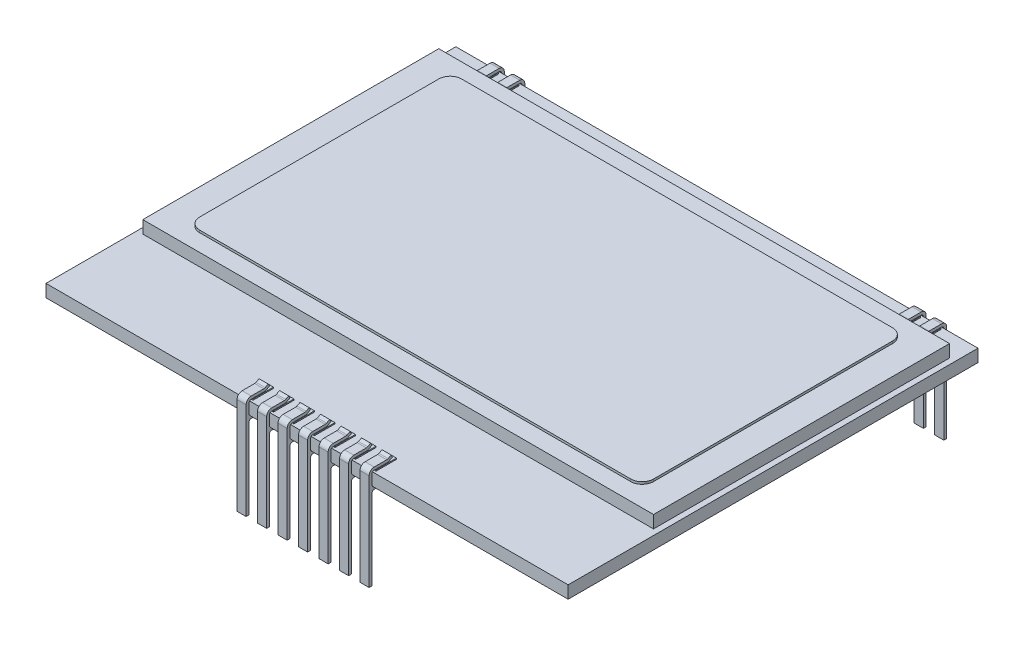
from build123d import *

# Parameters (mm, degrees)
EXTRUDE_START                 = 5
SKETCH_1_W                    = 45.86
SKETCH_1_H                    = 36
EXTRUDE_1_DEPTH               = 1.1
SKETCH_2_W                    = 44.86
SKETCH_2_H                    = 26
EXTRUDE_2_DEPTH               = 1.1
EXTRUDE_3_DEPTH               = 0.2
SKETCH_4_W                    = 0.9
SKETCH_4_H                    = 1.8
EXTRUDE_4_DEPTH               = 0.1
EXTRUDE_START_2               = 5.4
EXTRUDE_5_DEPTH               = 0.4
EXTRUDE_START_3               = 19.43
EXTRUDE_6_DEPTH               = 0.4
PATTERN_LINEAR_1_COUNT        = 7
PATTERN_LINEAR_1_PITCH        = 1.8
PATTERN_LINEAR_2_COUNT        = 2
PATTERN_LINEAR_2_PITCH        = 1.8
PATTERN_LINEAR_3_COUNT        = 2
PATTERN_LINEAR_3_PITCH        = 37.06
PATTERN_START                 = 19.43
PATTERN_LINEAR_3_COPY_1_DEPTH = 0.4


with BuildPart() as part:
    # Sketch 1 → Extrude 1 (new body)
    with BuildSketch(Plane(origin=(0, 0, 0), x_dir=(1, 0, 0), z_dir=(0, 1, 0)).offset(EXTRUDE_START)):
        Rectangle(SKETCH_1_W, SKETCH_1_H)
    extrude(amount=EXTRUDE_1_DEPTH)

    # Sketch 2 → Extrude 2 (add)
    with BuildSketch(Plane(origin=(0, 6.1, 0), x_dir=(1, 0, 0), z_dir=(0, 1, 0))):
        with Locations((0, 3)):
            Rectangle(SKETCH_2_W, SKETCH_2_H)
    extrude(amount=EXTRUDE_2_DEPTH)

    # Sketch 3 → Extrude 3 (add)
    with BuildSketch(Plane(origin=(0, 7.2, 0), x_dir=(1, 0, 0), z_dir=(0, 1, 0))):
        with BuildLine():
            Line((-18.93, 14.5), (18.93, 14.5))
            ThreePointArc((18.93, 14.5), (19.637106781, 14.207106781), (19.93, 13.5))
            Line((19.93, 13.5), (19.93, -7.5))
            ThreePointArc((19.93, -7.5), (19.637106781, -8.207106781), (18.93, -8.5))
            Line((18.93, -8.5), (-18.93, -8.5))
            ThreePointArc((-18.93, -8.5), (-19.637106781, -8.207106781), (-19.93, -7.5))
            Line((-19.93, -7.5), (-19.93, 13.5))
            ThreePointArc((-19.93, 13.5), (-19.637106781, 14.207106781), (-18.93, 14.5))
        make_face()
    extrude(amount=EXTRUDE_3_DEPTH)

    # Sketch 4 → Extrude 4 (add)
    with BuildSketch(Plane(origin=(0, 6.1, 0), x_dir=(1, 0, 0), z_dir=(0, 1, 0))):
        with Locations((-5.4, -16.9)):
            Rectangle(SKETCH_4_W, SKETCH_4_H)
        with Locations((-19.43, 16.9)):
            Rectangle(SKETCH_4_W, SKETCH_4_H)
        with Locations((-3.6, -16.9)):
            Rectangle(SKETCH_4_W, SKETCH_4_H)
        with Locations((-1.8, -16.9)):
            Rectangle(SKETCH_4_W, SKETCH_4_H)
        with Locations((0, -16.9)):
            Rectangle(SKETCH_4_W, SKETCH_4_H)
        with Locations((1.8, -16.9)):
            Rectangle(SKETCH_4_W, SKETCH_4_H)
        with Locations((3.6, -16.9)):
            Rectangle(SKETCH_4_W, SKETCH_4_H)
        with Locations((5.4, -16.9)):
            Rectangle(SKETCH_4_W, SKETCH_4_H)
        with Locations((-17.63, 16.9)):
            Rectangle(SKETCH_4_W, SKETCH_4_H)
        with Locations((17.63, 16.9)):
            Rectangle(SKETCH_4_W, SKETCH_4_H)
        with Locations((19.43, 16.9)):
            Rectangle(SKETCH_4_W, SKETCH_4_H)
    extrude(amount=EXTRUDE_4_DEPTH)

    # Sketch 5 → Extrude 5 (add, symmetric)
    with BuildSketch(Plane(origin=(0, 0, 0), x_dir=(0, 0, -1), z_dir=(1, 0, 0)).offset(EXTRUDE_START_2)):
        with BuildLine():
            Line((-18.1, 5.2), (-18.1, 6))
            ThreePointArc((-18.1, 6), (-18.041421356, 6.141421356), (-17.9, 6.2))
            Line((-17.9, 6.2), (-16.8, 6.2))
            ThreePointArc((-16.8, 6.2), (-16.678732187, 6.21492875), (-16.564705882, 6.258823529))
            Line((-16.564705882, 6.258823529), (-16.3, 6.4))
            Line((-16.3, 6.4), (-16.417647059, 6.620588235))
            Line((-16.417647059, 6.620588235), (-16.682352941, 6.479411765))
            ThreePointArc((-16.682352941, 6.479411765), (-16.739366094, 6.457464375), (-16.8, 6.45))
            Line((-16.8, 6.45), (-17.9, 6.45))
            ThreePointArc((-17.9, 6.45), (-18.218198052, 6.318198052), (-18.35, 6))
            Line((-18.35, 6), (-18.35, 5.2))
            Line((-18.35, 5.2), (-18.35, -2.5))
            Line((-18.35, -2.5), (-18.1, -2.5))
            Line((-18.1, -2.5), (-18.1, 4.55))
            ThreePointArc((-18.1, 4.55), (-18.041421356, 4.691421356), (-17.9, 4.75))
            Line((-17.9, 4.75), (-16.8, 4.75))
            ThreePointArc((-16.8, 4.75), (-16.739366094, 4.742535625), (-16.682352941, 4.720588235))
            Line((-16.682352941, 4.720588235), (-16.417647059, 4.579411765))
            Line((-16.417647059, 4.579411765), (-16.3, 4.8))
            Line((-16.3, 4.8), (-16.564705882, 4.941176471))
            ThreePointArc((-16.564705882, 4.941176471), (-16.678732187, 4.98507125), (-16.8, 5))
            Line((-16.8, 5), (-17.9, 5))
            ThreePointArc((-17.9, 5), (-18.041421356, 5.058578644), (-18.1, 5.2))
        make_face()
    extrude_5 = extrude(amount=EXTRUDE_5_DEPTH, both=True)

    # Sketch 6 → Extrude 6 (add, symmetric)
    with BuildSketch(Plane(origin=(0, 0, 0), x_dir=(0, 0, -1), z_dir=(1, 0, 0)).offset(EXTRUDE_START_3)):
        with BuildLine():
            Line((18.1, -2.5), (18.1, 4.55))
            ThreePointArc((18.1, 4.55), (18.041421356, 4.691421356), (17.9, 4.75))
            Line((17.9, 4.75), (16.8, 4.75))
            ThreePointArc((16.8, 4.75), (16.739366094, 4.742535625), (16.682352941, 4.720588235))
            Line((16.682352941, 4.720588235), (16.417647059, 4.579411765))
            Line((16.417647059, 4.579411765), (16.3, 4.8))
            Line((16.3, 4.8), (16.564705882, 4.941176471))
            ThreePointArc((16.564705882, 4.941176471), (16.678732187, 4.98507125), (16.8, 5))
            Line((16.8, 5), (17.9, 5))
            ThreePointArc((17.9, 5), (18.041421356, 5.058578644), (18.1, 5.2))
            Line((18.1, 5.2), (18.1, 6))
            ThreePointArc((18.1, 6), (18.041421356, 6.141421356), (17.9, 6.2))
            Line((17.9, 6.2), (16.8, 6.2))
            ThreePointArc((16.8, 6.2), (16.678732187, 6.21492875), (16.564705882, 6.258823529))
            Line((16.564705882, 6.258823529), (16.3, 6.4))
            Line((16.3, 6.4), (16.417647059, 6.620588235))
            Line((16.417647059, 6.620588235), (16.682352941, 6.479411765))
            ThreePointArc((16.682352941, 6.479411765), (16.739366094, 6.457464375), (16.8, 6.45))
            Line((16.8, 6.45), (17.9, 6.45))
            ThreePointArc((17.9, 6.45), (18.218198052, 6.318198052), (18.35, 6))
            Line((18.35, 6), (18.35, 5.2))
            Line((18.35, 5.2), (18.35, -2.5))
            Line((18.35, -2.5), (18.1, -2.5))
        make_face()
    extrude_6 = extrude(amount=EXTRUDE_6_DEPTH, both=True)

    # Pattern Linear 1: Extrude 5 ×7
    with Locations(*[(-i * PATTERN_LINEAR_1_PITCH, 0, 0) for i in range(1, PATTERN_LINEAR_1_COUNT)]):
        add(extrude_5)

    # Pattern Linear 2: Extrude 6 ×2
    with Locations(*[(-i * PATTERN_LINEAR_2_PITCH, 0, 0) for i in range(1, PATTERN_LINEAR_2_COUNT)]):
        add(extrude_6)

    # Pattern Linear 3: Extrude 6 ×2
    with Locations(*[(-i * PATTERN_LINEAR_3_PITCH, 0, 0) for i in range(1, PATTERN_LINEAR_3_COUNT)]):
        add(extrude_6)

    # Pattern Linear 3 copy 1 sketch → Pattern Linear 3 copy 1 (add, symmetric)
    with BuildSketch(Plane(origin=(-38.86, 0, 0), x_dir=(0, 0, -1), z_dir=(1, 0, 0)).offset(PATTERN_START)):
        with BuildLine():
            Line((18.1, -2.5), (18.1, 4.55))
            ThreePointArc((18.1, 4.55), (18.041421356, 4.691421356), (17.9, 4.75))
            Line((17.9, 4.75), (16.8, 4.75))
            ThreePointArc((16.8, 4.75), (16.739366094, 4.742535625), (16.682352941, 4.720588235))
            Line((16.682352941, 4.720588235), (16.417647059, 4.579411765))
            Line((16.417647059, 4.579411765), (16.3, 4.8))
            Line((16.3, 4.8), (16.564705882, 4.941176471))
            ThreePointArc((16.564705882, 4.941176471), (16.678732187, 4.98507125), (16.8, 5))
            Line((16.8, 5), (17.9, 5))
            ThreePointArc((17.9, 5), (18.041421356, 5.058578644), (18.1, 5.2))
            Line((18.1, 5.2), (18.1, 6))
            ThreePointArc((18.1, 6), (18.041421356, 6.141421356), (17.9, 6.2))
            Line((17.9, 6.2), (16.8, 6.2))
            ThreePointArc((16.8, 6.2), (16.678732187, 6.21492875), (16.564705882, 6.258823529))
            Line((16.564705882, 6.258823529), (16.3, 6.4))
            Line((16.3, 6.4), (16.417647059, 6.620588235))
            Line((16.417647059, 6.620588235), (16.682352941, 6.479411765))
            ThreePointArc((16.682352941, 6.479411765), (16.739366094, 6.457464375), (16.8, 6.45))
            Line((16.8, 6.45), (17.9, 6.45))
            ThreePointArc((17.9, 6.45), (18.218198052, 6.318198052), (18.35, 6))
            Line((18.35, 6), (18.35, 5.2))
            Line((18.35, 5.2), (18.35, -2.5))
            Line((18.35, -2.5), (18.1, -2.5))
        make_face()
    extrude(amount=PATTERN_LINEAR_3_COPY_1_DEPTH, both=True)


solid = part.part
